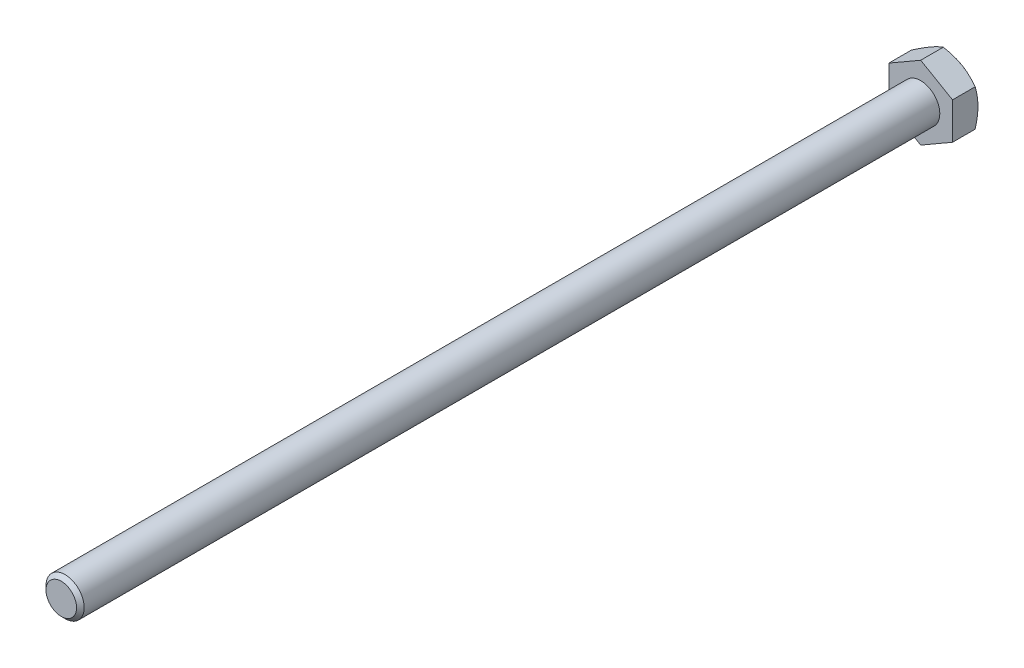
ISO-10303-21;
HEADER;
FILE_DESCRIPTION(('STEP AP214'),'2;1');
FILE_NAME('part.step','',(''),(''),'','','');
FILE_SCHEMA(('AUTOMOTIVE_DESIGN { 1 0 10303 214 1 1 1 1 }'));
ENDSEC;
DATA;
#1=APPLICATION_CONTEXT('core data for automotive mechanical design processes');
#2=APPLICATION_PROTOCOL_DEFINITION('international standard','automotive_design',2000,#1);
#3=PRODUCT_CONTEXT('',#1,'mechanical');
#4=PRODUCT('Part','Part','',(#3));
#5=PRODUCT_RELATED_PRODUCT_CATEGORY('part','',(#4));
#6=PRODUCT_DEFINITION_FORMATION('','',#4);
#7=PRODUCT_DEFINITION_CONTEXT('part definition',#1,'design');
#8=PRODUCT_DEFINITION('design','',#6,#7);
#9=PRODUCT_DEFINITION_SHAPE('','',#8);
#10=(LENGTH_UNIT() NAMED_UNIT(*) SI_UNIT(.MILLI.,.METRE.));
#11=(NAMED_UNIT(*) PLANE_ANGLE_UNIT() SI_UNIT($,.RADIAN.));
#12=(NAMED_UNIT(*) SI_UNIT($,.STERADIAN.) SOLID_ANGLE_UNIT());
#13=UNCERTAINTY_MEASURE_WITH_UNIT(LENGTH_MEASURE(1.E-05),#10,'distance_accuracy_value','');
#14=(GEOMETRIC_REPRESENTATION_CONTEXT(3) GLOBAL_UNCERTAINTY_ASSIGNED_CONTEXT((#13)) GLOBAL_UNIT_ASSIGNED_CONTEXT((#10,
#11,#12)) REPRESENTATION_CONTEXT('',''));
#15=CARTESIAN_POINT('',(0.,0.,0.));
#16=DIRECTION('',(0.,0.,1.));
#17=DIRECTION('',(1.,0.,0.));
#18=AXIS2_PLACEMENT_3D('',#15,#16,#17);
#19=CARTESIAN_POINT('',(0.,0.,135.));
#20=DIRECTION('',(0.,0.,1.));
#21=DIRECTION('',(1.,0.,0.));
#22=AXIS2_PLACEMENT_3D('',#19,#20,#21);
#23=PLANE('',#22);
#24=CARTESIAN_POINT('',(0.,0.,135.));
#25=DIRECTION('',(0.,0.,1.));
#26=DIRECTION('',(1.,0.,0.));
#27=AXIS2_PLACEMENT_3D('',#24,#25,#26);
#28=CIRCLE('',#27,2.40000000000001);
#29=CARTESIAN_POINT('',(2.40000000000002,0.,135.));
#30=VERTEX_POINT('',#29);
#31=EDGE_CURVE('E214',#30,#30,#28,.T.);
#32=ORIENTED_EDGE('',*,*,#31,.T.);
#33=EDGE_LOOP('',(#32));
#34=FACE_BOUND('',#33,.T.);
#35=ADVANCED_FACE('F40',(#34),#23,.T.);
#36=CARTESIAN_POINT('',(0.,0.,0.));
#37=DIRECTION('',(0.,0.,1.));
#38=DIRECTION('',(1.,0.,0.));
#39=AXIS2_PLACEMENT_3D('',#36,#37,#38);
#40=CYLINDRICAL_SURFACE('',#39,3.);
#41=CARTESIAN_POINT('',(0.,0.,134.4));
#42=DIRECTION('',(0.,0.,1.));
#43=DIRECTION('',(1.,0.,0.));
#44=AXIS2_PLACEMENT_3D('',#41,#42,#43);
#45=CIRCLE('',#44,3.);
#46=CARTESIAN_POINT('',(3.00000000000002,0.,134.4));
#47=VERTEX_POINT('',#46);
#48=EDGE_CURVE('E216',#47,#47,#45,.F.);
#49=ORIENTED_EDGE('',*,*,#48,.T.);
#50=EDGE_LOOP('',(#49));
#51=FACE_BOUND('',#50,.T.);
#52=CARTESIAN_POINT('',(0.,0.,0.));
#53=DIRECTION('',(0.,0.,1.));
#54=DIRECTION('',(1.,0.,0.));
#55=AXIS2_PLACEMENT_3D('',#52,#53,#54);
#56=CIRCLE('',#55,3.);
#57=CARTESIAN_POINT('',(3.,0.,0.));
#58=VERTEX_POINT('',#57);
#59=EDGE_CURVE('E217',#58,#58,#56,.F.);
#60=ORIENTED_EDGE('',*,*,#59,.F.);
#61=EDGE_LOOP('',(#60));
#62=FACE_BOUND('',#61,.T.);
#63=ADVANCED_FACE('F205',(#51,#62),#40,.T.);
#64=CARTESIAN_POINT('',(0.,0.,135.));
#65=DIRECTION('',(0.,0.,-1.));
#66=DIRECTION('',(-1.,0.,0.));
#67=AXIS2_PLACEMENT_3D('',#64,#65,#66);
#68=CONICAL_SURFACE('',#67,2.40000000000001,0.78539816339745);
#69=ORIENTED_EDGE('',*,*,#48,.F.);
#70=EDGE_LOOP('',(#69));
#71=FACE_BOUND('',#70,.T.);
#72=ORIENTED_EDGE('',*,*,#31,.F.);
#73=EDGE_LOOP('',(#72));
#74=FACE_BOUND('',#73,.T.);
#75=ADVANCED_FACE('F210',(#71,#74),#68,.T.);
#76=CARTESIAN_POINT('',(0.,5.77350269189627,-4.));
#77=DIRECTION('',(0.499999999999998,0.86602540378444,0.));
#78=DIRECTION('',(-0.86602540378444,0.499999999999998,0.));
#79=AXIS2_PLACEMENT_3D('',#76,#77,#78);
#80=PLANE('',#79);
#81=CARTESIAN_POINT('',(-0.000200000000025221,5.77361816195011,-3.55335134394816));
#82=CARTESIAN_POINT('',(0.21953459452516,5.64675433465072,-3.62661343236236));
#83=CARTESIAN_POINT('',(0.441148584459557,5.51880543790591,-3.6932486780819));
#84=CARTESIAN_POINT('',(0.888213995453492,5.26069210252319,-3.80956100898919));
#85=CARTESIAN_POINT('',(1.11367335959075,5.13052307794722,-3.85919695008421));
#86=CARTESIAN_POINT('',(1.56183230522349,4.87177839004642,-3.9364489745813));
#87=CARTESIAN_POINT('',(1.78446209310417,4.74324302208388,-3.96457962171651));
#88=CARTESIAN_POINT('',(2.11918990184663,4.54998783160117,-3.98980507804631));
#89=CARTESIAN_POINT('',(2.23084219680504,4.48552534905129,-3.99538654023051));
#90=CARTESIAN_POINT('',(2.45424997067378,4.35654081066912,-4.00079778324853));
#91=CARTESIAN_POINT('',(2.5660054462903,4.29201875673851,-4.0006277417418));
#92=CARTESIAN_POINT('',(2.87218423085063,4.11524635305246,-3.99224636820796));
#93=CARTESIAN_POINT('',(3.0665060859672,4.00305457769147,-3.97817022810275));
#94=CARTESIAN_POINT('',(3.4538601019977,3.77941563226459,-3.93353474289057));
#95=CARTESIAN_POINT('',(3.64689090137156,3.6679692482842,-3.90296013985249));
#96=CARTESIAN_POINT('',(4.03502534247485,3.44387972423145,-3.82653150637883));
#97=CARTESIAN_POINT('',(4.23007999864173,3.33126486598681,-3.78035362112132));
#98=CARTESIAN_POINT('',(4.61728034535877,3.10771464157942,-3.67554820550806));
#99=CARTESIAN_POINT('',(4.80943099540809,2.99677641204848,-3.61694529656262));
#100=CARTESIAN_POINT('',(5.0002,2.8866358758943,-3.55335134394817));
#101=B_SPLINE_CURVE_WITH_KNOTS('',3,(#81,#82,#83,#84,#85,#86,#87,#88,#89,#90,#91,#92,#93,#94,
#95,#96,#97,#98,#99,#100),.UNSPECIFIED.,.F.,.F.,(4,2,2,2,2,2,2,2,2,4),(0.,0.792555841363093,
1.58701660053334,2.36181537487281,2.74884076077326,3.13585419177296,3.8096236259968,
4.48401723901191,5.17336882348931,5.86136694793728),.UNSPECIFIED.);
#102=CARTESIAN_POINT('',(0.,5.77350269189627,-3.55341801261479));
#103=VERTEX_POINT('',#102);
#104=CARTESIAN_POINT('',(2.49999999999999,4.3301270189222,-4.));
#105=VERTEX_POINT('',#104);
#106=EDGE_CURVE('E250',#103,#105,#101,.T.);
#107=ORIENTED_EDGE('',*,*,#106,.F.);
#108=DIRECTION('',(0.,0.,1.));
#109=VECTOR('',#108,1.);
#110=CARTESIAN_POINT('',(0.,5.77350269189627,-4.));
#111=LINE('',#110,#109);
#112=CARTESIAN_POINT('',(0.,5.77350269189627,0.));
#113=VERTEX_POINT('',#112);
#114=EDGE_CURVE('E224',#103,#113,#111,.T.);
#115=ORIENTED_EDGE('',*,*,#114,.T.);
#116=DIRECTION('',(-0.86602540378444,0.499999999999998,0.));
#117=VECTOR('',#116,1.);
#118=CARTESIAN_POINT('',(0.,5.77350269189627,0.));
#119=LINE('',#118,#117);
#120=CARTESIAN_POINT('',(5.,2.88675134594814,0.));
#121=VERTEX_POINT('',#120);
#122=EDGE_CURVE('E248',#121,#113,#119,.T.);
#123=ORIENTED_EDGE('',*,*,#122,.F.);
#124=DIRECTION('',(0.,0.,1.));
#125=VECTOR('',#124,1.);
#126=CARTESIAN_POINT('',(5.,2.88675134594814,-4.));
#127=LINE('',#126,#125);
#128=CARTESIAN_POINT('',(5.,2.88675134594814,-3.55341801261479));
#129=VERTEX_POINT('',#128);
#130=EDGE_CURVE('E221',#129,#121,#127,.T.);
#131=ORIENTED_EDGE('',*,*,#130,.F.);
#132=EDGE_CURVE('E180',#105,#129,#101,.T.);
#133=ORIENTED_EDGE('',*,*,#132,.F.);
#134=EDGE_LOOP('',(#107,#115,#123,#131,#133));
#135=FACE_BOUND('',#134,.T.);
#136=ADVANCED_FACE('F190',(#135),#80,.T.);
#137=CARTESIAN_POINT('',(5.,-2.88675134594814,-4.));
#138=DIRECTION('',(1.,0.,0.));
#139=DIRECTION('',(0.,0.,-1.));
#140=AXIS2_PLACEMENT_3D('',#137,#138,#139);
#141=PLANE('',#140);
#142=CARTESIAN_POINT('',(5.,-7.87365701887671,-1.5017575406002));
#143=CARTESIAN_POINT('',(5.,-7.65421637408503,-1.60868091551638));
#144=CARTESIAN_POINT('',(5.,-7.43428458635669,-1.71461296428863));
#145=CARTESIAN_POINT('',(5.,-6.99317792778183,-1.92393906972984));
#146=CARTESIAN_POINT('',(5.,-6.77200287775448,-2.02733274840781));
#147=CARTESIAN_POINT('',(5.,-6.32706593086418,-2.23152152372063));
#148=CARTESIAN_POINT('',(5.,-6.10329657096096,-2.3323004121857));
#149=CARTESIAN_POINT('',(5.,-5.65401907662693,-2.52988978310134));
#150=CARTESIAN_POINT('',(5.,-5.42851102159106,-2.62670044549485));
#151=CARTESIAN_POINT('',(5.,-4.96773019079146,-2.81850105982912));
#152=CARTESIAN_POINT('',(5.,-4.73238523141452,-2.91331851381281));
#153=CARTESIAN_POINT('',(5.,-4.2589865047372,-3.09606229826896));
#154=CARTESIAN_POINT('',(5.,-4.02093244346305,-3.18398787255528));
#155=CARTESIAN_POINT('',(5.,-3.54214478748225,-3.35072723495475));
#156=CARTESIAN_POINT('',(5.,-3.301417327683,-3.42955846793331));
#157=CARTESIAN_POINT('',(5.,-2.81651125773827,-3.57565910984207));
#158=CARTESIAN_POINT('',(5.,-2.57233372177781,-3.64293203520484));
#159=CARTESIAN_POINT('',(5.,-2.08173956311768,-3.7624103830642));
#160=CARTESIAN_POINT('',(5.,-1.83534384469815,-3.81470009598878));
#161=CARTESIAN_POINT('',(5.,-1.33936717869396,-3.90133365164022));
#162=CARTESIAN_POINT('',(5.,-1.08978658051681,-3.93567944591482));
#163=CARTESIAN_POINT('',(5.,-0.591994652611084,-3.98324171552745));
#164=CARTESIAN_POINT('',(5.,-0.343810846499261,-3.99673913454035));
#165=CARTESIAN_POINT('',(5.,0.152820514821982,-4.00220795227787));
#166=CARTESIAN_POINT('',(5.,0.401268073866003,-3.99417903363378));
#167=CARTESIAN_POINT('',(5.,0.819539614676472,-3.96311999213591));
#168=CARTESIAN_POINT('',(5.,0.989794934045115,-3.94552930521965));
#169=CARTESIAN_POINT('',(5.,1.32912938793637,-3.90127081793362));
#170=CARTESIAN_POINT('',(5.,1.4982083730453,-3.87460188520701));
#171=CARTESIAN_POINT('',(5.,2.00341173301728,-3.78237229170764));
#172=CARTESIAN_POINT('',(5.,2.33733597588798,-3.7046029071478));
#173=CARTESIAN_POINT('',(5.,2.83691487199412,-3.56883106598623));
#174=CARTESIAN_POINT('',(5.,3.00513229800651,-3.51971360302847));
#175=CARTESIAN_POINT('',(5.,3.33993504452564,-3.41615110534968));
#176=CARTESIAN_POINT('',(5.,3.50652035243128,-3.36170602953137));
#177=CARTESIAN_POINT('',(5.,3.83810926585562,-3.24838071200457));
#178=CARTESIAN_POINT('',(5.,4.00311330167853,-3.18950171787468));
#179=CARTESIAN_POINT('',(5.,4.33173746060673,-3.06802383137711));
#180=CARTESIAN_POINT('',(5.,4.49535761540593,-3.00542502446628));
#181=CARTESIAN_POINT('',(5.,4.93598294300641,-2.83201950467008));
#182=CARTESIAN_POINT('',(5.,5.21182602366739,-2.71826266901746));
#183=CARTESIAN_POINT('',(5.,5.76066658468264,-2.48405585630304));
#184=CARTESIAN_POINT('',(5.,6.03366374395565,-2.36360513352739));
#185=CARTESIAN_POINT('',(5.,6.57746623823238,-2.11759609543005));
#186=CARTESIAN_POINT('',(5.,6.84827068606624,-1.99203582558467));
#187=CARTESIAN_POINT('',(5.,7.38802449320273,-1.73703058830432));
#188=CARTESIAN_POINT('',(5.,7.65697392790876,-1.60758577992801));
#189=CARTESIAN_POINT('',(5.,8.19381940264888,-1.34544789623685));
#190=CARTESIAN_POINT('',(5.,8.46171304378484,-1.21274991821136));
#191=CARTESIAN_POINT('',(5.,8.99628800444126,-0.944933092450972));
#192=CARTESIAN_POINT('',(5.,9.2629693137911,-0.809814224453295));
#193=CARTESIAN_POINT('',(5.,10.0614145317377,-0.40162739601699));
#194=CARTESIAN_POINT('',(5.,10.5917004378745,-0.12566969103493));
#195=CARTESIAN_POINT('',(5.,11.5934978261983,0.401869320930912));
#196=CARTESIAN_POINT('',(5.,12.0652823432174,0.652934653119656));
#197=CARTESIAN_POINT('',(5.,13.0072652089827,1.15809174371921));
#198=CARTESIAN_POINT('',(5.,13.4774634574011,1.41218368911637));
#199=CARTESIAN_POINT('',(5.,14.4150598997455,1.92174727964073));
#200=CARTESIAN_POINT('',(5.,14.8824621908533,2.17721139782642));
#201=CARTESIAN_POINT('',(5.,15.8162766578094,2.68985606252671));
#202=CARTESIAN_POINT('',(5.,16.2826889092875,2.94703647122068));
#203=CARTESIAN_POINT('',(5.,16.7487534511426,3.20484156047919));
#204=B_SPLINE_CURVE_WITH_KNOTS('',3,(#142,#143,#144,#145,#146,#147,#148,#149,#150,#151,#152,
#153,#154,#155,#156,#157,#158,#159,#160,#161,#162,#163,#164,#165,#166,#167,#168,#169,#170,#171,
#172,#173,#174,#175,#176,#177,#178,#179,#180,#181,#182,#183,#184,#185,#186,#187,#188,#189,#190,
#191,#192,#193,#194,#195,#196,#197,#198,#199,#200,#201,#202,#203),.UNSPECIFIED.,.F.,.F.,(4,2,2,
2,2,2,2,2,2,2,2,2,2,2,2,2,2,2,2,2,2,2,2,2,2,2,2,2,2,2,4),(0.,0.732320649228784,1.46474969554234,
2.20096737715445,2.93715163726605,3.69825037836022,4.45943251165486,5.2191293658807,
5.97859468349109,6.73369963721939,7.48872245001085,8.23347928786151,8.97824710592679,
9.49148539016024,10.0047877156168,11.0318914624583,11.5575684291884,12.0832494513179,
12.6087831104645,13.1343047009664,14.0293094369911,14.9244140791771,15.819864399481,
16.7152781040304,17.612136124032,18.5090016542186,20.3023290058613,21.9056050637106,
23.5089806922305,25.106957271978,26.7048070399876),.UNSPECIFIED.);
#205=CARTESIAN_POINT('',(5.,0.,-4.));
#206=VERTEX_POINT('',#205);
#207=EDGE_CURVE('E178',#129,#206,#204,.F.);
#208=ORIENTED_EDGE('',*,*,#207,.F.);
#209=ORIENTED_EDGE('',*,*,#130,.T.);
#210=DIRECTION('',(0.,1.,0.));
#211=VECTOR('',#210,1.);
#212=CARTESIAN_POINT('',(5.,-2.88675134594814,0.));
#213=LINE('',#212,#211);
#214=CARTESIAN_POINT('',(5.,-2.88675134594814,0.));
#215=VERTEX_POINT('',#214);
#216=EDGE_CURVE('E226',#215,#121,#213,.T.);
#217=ORIENTED_EDGE('',*,*,#216,.F.);
#218=DIRECTION('',(0.,0.,1.));
#219=VECTOR('',#218,1.);
#220=CARTESIAN_POINT('',(5.,-2.88675134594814,-4.));
#221=LINE('',#220,#219);
#222=CARTESIAN_POINT('',(5.,-2.88675134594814,-3.55341801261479));
#223=VERTEX_POINT('',#222);
#224=EDGE_CURVE('E232',#223,#215,#221,.T.);
#225=ORIENTED_EDGE('',*,*,#224,.F.);
#226=EDGE_CURVE('E173',#206,#223,#204,.F.);
#227=ORIENTED_EDGE('',*,*,#226,.F.);
#228=EDGE_LOOP('',(#208,#209,#217,#225,#227));
#229=FACE_BOUND('',#228,.T.);
#230=ADVANCED_FACE('F186',(#229),#141,.T.);
#231=CARTESIAN_POINT('',(0.,-5.77350269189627,-4.));
#232=DIRECTION('',(0.499999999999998,-0.86602540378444,0.));
#233=DIRECTION('',(0.86602540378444,0.499999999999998,0.));
#234=AXIS2_PLACEMENT_3D('',#231,#232,#233);
#235=PLANE('',#234);
#236=CARTESIAN_POINT('',(5.0002,-2.8866358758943,-3.55335134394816));
#237=CARTESIAN_POINT('',(4.78046540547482,-3.01349970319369,-3.62661343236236));
#238=CARTESIAN_POINT('',(4.55885141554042,-3.1414485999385,-3.6932486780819));
#239=CARTESIAN_POINT('',(4.11178600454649,-3.39956193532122,-3.80956100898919));
#240=CARTESIAN_POINT('',(3.88632664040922,-3.52973095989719,-3.85919695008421));
#241=CARTESIAN_POINT('',(3.43816769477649,-3.78847564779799,-3.9364489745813));
#242=CARTESIAN_POINT('',(3.2155379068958,-3.91701101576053,-3.96457962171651));
#243=CARTESIAN_POINT('',(2.88081009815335,-4.11026620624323,-3.98980507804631));
#244=CARTESIAN_POINT('',(2.76915780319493,-4.17472868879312,-3.99538654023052));
#245=CARTESIAN_POINT('',(2.54575002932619,-4.30371322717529,-4.00079778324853));
#246=CARTESIAN_POINT('',(2.43399455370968,-4.3682352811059,-4.0006277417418));
#247=CARTESIAN_POINT('',(2.12781576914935,-4.54500768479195,-3.99224636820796));
#248=CARTESIAN_POINT('',(1.93349391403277,-4.65719946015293,-3.97817022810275));
#249=CARTESIAN_POINT('',(1.54613989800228,-4.88083840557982,-3.93353474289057));
#250=CARTESIAN_POINT('',(1.35310909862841,-4.99228478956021,-3.90296013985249));
#251=CARTESIAN_POINT('',(0.964974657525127,-5.21637431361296,-3.82653150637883));
#252=CARTESIAN_POINT('',(0.769920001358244,-5.3289891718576,-3.78035362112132));
#253=CARTESIAN_POINT('',(0.382719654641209,-5.55253939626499,-3.67554820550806));
#254=CARTESIAN_POINT('',(0.19056900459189,-5.66347762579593,-3.61694529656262));
#255=CARTESIAN_POINT('',(-0.000200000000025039,-5.77361816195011,-3.55335134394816));
#256=B_SPLINE_CURVE_WITH_KNOTS('',3,(#236,#237,#238,#239,#240,#241,#242,#243,#244,#245,#246,
#247,#248,#249,#250,#251,#252,#253,#254,#255),.UNSPECIFIED.,.F.,.F.,(4,2,2,2,2,2,2,2,2,4),(0.,
0.792555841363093,1.58701660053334,2.36181537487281,2.74884076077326,3.13585419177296,
3.80962362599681,4.48401723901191,5.17336882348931,5.86136694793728),.UNSPECIFIED.);
#257=CARTESIAN_POINT('',(2.49999999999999,-4.3301270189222,-4.));
#258=VERTEX_POINT('',#257);
#259=EDGE_CURVE('E179',#223,#258,#256,.T.);
#260=ORIENTED_EDGE('',*,*,#259,.F.);
#261=ORIENTED_EDGE('',*,*,#224,.T.);
#262=DIRECTION('',(0.86602540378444,0.499999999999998,0.));
#263=VECTOR('',#262,1.);
#264=CARTESIAN_POINT('',(0.,-5.77350269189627,0.));
#265=LINE('',#264,#263);
#266=CARTESIAN_POINT('',(0.,-5.77350269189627,0.));
#267=VERTEX_POINT('',#266);
#268=EDGE_CURVE('E237',#267,#215,#265,.T.);
#269=ORIENTED_EDGE('',*,*,#268,.F.);
#270=DIRECTION('',(0.,0.,1.));
#271=VECTOR('',#270,1.);
#272=CARTESIAN_POINT('',(0.,-5.77350269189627,-4.));
#273=LINE('',#272,#271);
#274=CARTESIAN_POINT('',(0.,-5.77350269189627,-3.55341801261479));
#275=VERTEX_POINT('',#274);
#276=EDGE_CURVE('E230',#275,#267,#273,.T.);
#277=ORIENTED_EDGE('',*,*,#276,.F.);
#278=EDGE_CURVE('E167',#258,#275,#256,.T.);
#279=ORIENTED_EDGE('',*,*,#278,.F.);
#280=EDGE_LOOP('',(#260,#261,#269,#277,#279));
#281=FACE_BOUND('',#280,.T.);
#282=ADVANCED_FACE('F189',(#281),#235,.T.);
#283=CARTESIAN_POINT('',(0.,-5.77350269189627,-4.));
#284=DIRECTION('',(-0.500000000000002,-0.866025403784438,0.));
#285=DIRECTION('',(0.866025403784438,-0.500000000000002,0.));
#286=AXIS2_PLACEMENT_3D('',#283,#284,#285);
#287=PLANE('',#286);
#288=CARTESIAN_POINT('',(0.000199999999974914,-5.77361816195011,-3.55335134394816));
#289=CARTESIAN_POINT('',(-0.219534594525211,-5.64675433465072,-3.62661343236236));
#290=CARTESIAN_POINT('',(-0.441148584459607,-5.5188054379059,-3.6932486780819));
#291=CARTESIAN_POINT('',(-0.88821399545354,-5.26069210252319,-3.80956100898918));
#292=CARTESIAN_POINT('',(-1.1136733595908,-5.13052307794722,-3.85919695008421));
#293=CARTESIAN_POINT('',(-1.56183230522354,-4.87177839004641,-3.9364489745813));
#294=CARTESIAN_POINT('',(-1.78446209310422,-4.74324302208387,-3.96457962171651));
#295=CARTESIAN_POINT('',(-2.11918990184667,-4.54998783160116,-3.98980507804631));
#296=CARTESIAN_POINT('',(-2.23084219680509,-4.48552534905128,-3.99538654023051));
#297=CARTESIAN_POINT('',(-2.45424997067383,-4.35654081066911,-4.00079778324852));
#298=CARTESIAN_POINT('',(-2.56600544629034,-4.2920187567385,-4.00062774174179));
#299=CARTESIAN_POINT('',(-2.87218423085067,-4.11524635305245,-3.99224636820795));
#300=CARTESIAN_POINT('',(-3.06650608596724,-4.00305457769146,-3.97817022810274));
#301=CARTESIAN_POINT('',(-3.45386010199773,-3.77941563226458,-3.93353474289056));
#302=CARTESIAN_POINT('',(-3.64689090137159,-3.66796924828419,-3.90296013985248));
#303=CARTESIAN_POINT('',(-4.03502534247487,-3.44387972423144,-3.82653150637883));
#304=CARTESIAN_POINT('',(-4.23007999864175,-3.33126486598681,-3.78035362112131));
#305=CARTESIAN_POINT('',(-4.61728034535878,-3.10771464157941,-3.67554820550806));
#306=CARTESIAN_POINT('',(-4.80943099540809,-2.99677641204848,-3.61694529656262));
#307=CARTESIAN_POINT('',(-5.0002,-2.8866358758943,-3.55335134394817));
#308=B_SPLINE_CURVE_WITH_KNOTS('',3,(#288,#289,#290,#291,#292,#293,#294,#295,#296,#297,#298,
#299,#300,#301,#302,#303,#304,#305,#306,#307),.UNSPECIFIED.,.F.,.F.,(4,2,2,2,2,2,2,2,2,4),(0.,
0.792555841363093,1.58701660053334,2.36181537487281,2.74884076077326,3.13585419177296,
3.80962362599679,4.48401723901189,5.17336882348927,5.86136694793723),.UNSPECIFIED.);
#309=CARTESIAN_POINT('',(-2.50000000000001,-4.33012701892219,-4.));
#310=VERTEX_POINT('',#309);
#311=EDGE_CURVE('E269',#275,#310,#308,.T.);
#312=ORIENTED_EDGE('',*,*,#311,.F.);
#313=ORIENTED_EDGE('',*,*,#276,.T.);
#314=DIRECTION('',(0.866025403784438,-0.500000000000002,0.));
#315=VECTOR('',#314,1.);
#316=CARTESIAN_POINT('',(0.,-5.77350269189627,0.));
#317=LINE('',#316,#315);
#318=CARTESIAN_POINT('',(-5.,-2.88675134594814,0.));
#319=VERTEX_POINT('',#318);
#320=EDGE_CURVE('E240',#319,#267,#317,.T.);
#321=ORIENTED_EDGE('',*,*,#320,.F.);
#322=DIRECTION('',(0.,0.,1.));
#323=VECTOR('',#322,1.);
#324=CARTESIAN_POINT('',(-5.,-2.88675134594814,-4.));
#325=LINE('',#324,#323);
#326=CARTESIAN_POINT('',(-5.,-2.88675134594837,-3.55341801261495));
#327=VERTEX_POINT('',#326);
#328=EDGE_CURVE('E228',#327,#319,#325,.T.);
#329=ORIENTED_EDGE('',*,*,#328,.F.);
#330=EDGE_CURVE('E116',#310,#327,#308,.T.);
#331=ORIENTED_EDGE('',*,*,#330,.F.);
#332=EDGE_LOOP('',(#312,#313,#321,#329,#331));
#333=FACE_BOUND('',#332,.T.);
#334=ADVANCED_FACE('F194',(#333),#287,.T.);
#335=CARTESIAN_POINT('',(-5.,-2.88675134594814,-4.));
#336=DIRECTION('',(-1.,0.,0.));
#337=DIRECTION('',(0.,0.,1.));
#338=AXIS2_PLACEMENT_3D('',#335,#336,#337);
#339=PLANE('',#338);
#340=CARTESIAN_POINT('',(-5.,-7.87365701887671,-1.5017575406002));
#341=CARTESIAN_POINT('',(-5.,-7.65421637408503,-1.60868091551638));
#342=CARTESIAN_POINT('',(-5.,-7.43428458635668,-1.71461296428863));
#343=CARTESIAN_POINT('',(-5.,-6.99317792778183,-1.92393906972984));
#344=CARTESIAN_POINT('',(-5.,-6.77200287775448,-2.02733274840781));
#345=CARTESIAN_POINT('',(-5.,-6.32706593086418,-2.23152152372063));
#346=CARTESIAN_POINT('',(-5.,-6.10329657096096,-2.3323004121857));
#347=CARTESIAN_POINT('',(-5.,-5.65401907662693,-2.52988978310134));
#348=CARTESIAN_POINT('',(-5.,-5.42851102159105,-2.62670044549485));
#349=CARTESIAN_POINT('',(-5.,-4.96773019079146,-2.81850105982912));
#350=CARTESIAN_POINT('',(-5.,-4.73238523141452,-2.91331851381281));
#351=CARTESIAN_POINT('',(-5.,-4.2589865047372,-3.09606229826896));
#352=CARTESIAN_POINT('',(-5.,-4.02093244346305,-3.18398787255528));
#353=CARTESIAN_POINT('',(-5.,-3.54214478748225,-3.35072723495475));
#354=CARTESIAN_POINT('',(-5.,-3.301417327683,-3.42955846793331));
#355=CARTESIAN_POINT('',(-5.,-2.81651125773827,-3.57565910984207));
#356=CARTESIAN_POINT('',(-5.,-2.57233372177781,-3.64293203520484));
#357=CARTESIAN_POINT('',(-5.,-2.08173956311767,-3.7624103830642));
#358=CARTESIAN_POINT('',(-5.,-1.83534384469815,-3.81470009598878));
#359=CARTESIAN_POINT('',(-5.,-1.33936717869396,-3.90133365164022));
#360=CARTESIAN_POINT('',(-5.,-1.08978658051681,-3.93567944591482));
#361=CARTESIAN_POINT('',(-5.,-0.591994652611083,-3.98324171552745));
#362=CARTESIAN_POINT('',(-5.,-0.343810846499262,-3.99673913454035));
#363=CARTESIAN_POINT('',(-5.,0.152820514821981,-4.00220795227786));
#364=CARTESIAN_POINT('',(-5.,0.401268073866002,-3.99417903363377));
#365=CARTESIAN_POINT('',(-5.,0.819539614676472,-3.96311999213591));
#366=CARTESIAN_POINT('',(-5.,0.989794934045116,-3.94552930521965));
#367=CARTESIAN_POINT('',(-5.,1.32912938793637,-3.90127081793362));
#368=CARTESIAN_POINT('',(-5.,1.4982083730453,-3.87460188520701));
#369=CARTESIAN_POINT('',(-5.,2.00341173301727,-3.78237229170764));
#370=CARTESIAN_POINT('',(-5.,2.33733597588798,-3.7046029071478));
#371=CARTESIAN_POINT('',(-5.,2.83691487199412,-3.56883106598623));
#372=CARTESIAN_POINT('',(-5.,3.00513229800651,-3.51971360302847));
#373=CARTESIAN_POINT('',(-5.,3.33993504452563,-3.41615110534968));
#374=CARTESIAN_POINT('',(-5.,3.50652035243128,-3.36170602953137));
#375=CARTESIAN_POINT('',(-5.,3.83810926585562,-3.24838071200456));
#376=CARTESIAN_POINT('',(-5.,4.00311330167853,-3.18950171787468));
#377=CARTESIAN_POINT('',(-5.,4.33173746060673,-3.06802383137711));
#378=CARTESIAN_POINT('',(-5.,4.49535761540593,-3.00542502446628));
#379=CARTESIAN_POINT('',(-5.,4.93598294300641,-2.83201950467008));
#380=CARTESIAN_POINT('',(-5.,5.21182602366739,-2.71826266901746));
#381=CARTESIAN_POINT('',(-5.,5.76066658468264,-2.48405585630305));
#382=CARTESIAN_POINT('',(-5.,6.03366374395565,-2.36360513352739));
#383=CARTESIAN_POINT('',(-5.,6.57746623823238,-2.11759609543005));
#384=CARTESIAN_POINT('',(-5.,6.84827068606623,-1.99203582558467));
#385=CARTESIAN_POINT('',(-5.,7.38802449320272,-1.73703058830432));
#386=CARTESIAN_POINT('',(-5.,7.65697392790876,-1.60758577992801));
#387=CARTESIAN_POINT('',(-5.,8.19381940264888,-1.34544789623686));
#388=CARTESIAN_POINT('',(-5.,8.46171304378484,-1.21274991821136));
#389=CARTESIAN_POINT('',(-5.,8.99628800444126,-0.944933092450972));
#390=CARTESIAN_POINT('',(-5.,9.26296931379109,-0.809814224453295));
#391=CARTESIAN_POINT('',(-5.,10.0614145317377,-0.40162739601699));
#392=CARTESIAN_POINT('',(-5.,10.5917004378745,-0.125669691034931));
#393=CARTESIAN_POINT('',(-5.,11.5934978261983,0.40186932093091));
#394=CARTESIAN_POINT('',(-5.,12.0652823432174,0.652934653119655));
#395=CARTESIAN_POINT('',(-5.,13.0072652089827,1.15809174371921));
#396=CARTESIAN_POINT('',(-5.,13.4774634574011,1.41218368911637));
#397=CARTESIAN_POINT('',(-5.,14.4150598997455,1.92174727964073));
#398=CARTESIAN_POINT('',(-5.,14.8824621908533,2.17721139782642));
#399=CARTESIAN_POINT('',(-5.,15.8162766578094,2.68985606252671));
#400=CARTESIAN_POINT('',(-5.,16.2826889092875,2.94703647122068));
#401=CARTESIAN_POINT('',(-5.,16.7487534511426,3.20484156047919));
#402=B_SPLINE_CURVE_WITH_KNOTS('',3,(#340,#341,#342,#343,#344,#345,#346,#347,#348,#349,#350,
#351,#352,#353,#354,#355,#356,#357,#358,#359,#360,#361,#362,#363,#364,#365,#366,#367,#368,#369,
#370,#371,#372,#373,#374,#375,#376,#377,#378,#379,#380,#381,#382,#383,#384,#385,#386,#387,#388,
#389,#390,#391,#392,#393,#394,#395,#396,#397,#398,#399,#400,#401),.UNSPECIFIED.,.F.,.F.,(4,2,2,
2,2,2,2,2,2,2,2,2,2,2,2,2,2,2,2,2,2,2,2,2,2,2,2,2,2,2,4),(0.,0.732320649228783,1.46474969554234,
2.20096737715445,2.93715163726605,3.69825037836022,4.45943251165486,5.2191293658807,
5.97859468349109,6.7336996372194,7.48872245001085,8.23347928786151,8.97824710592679,
9.49148539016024,10.0047877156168,11.0318914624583,11.5575684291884,12.0832494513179,
12.6087831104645,13.1343047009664,14.0293094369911,14.9244140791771,15.819864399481,
16.7152781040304,17.612136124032,18.5090016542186,20.3023290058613,21.9056050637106,
23.5089806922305,25.106957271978,26.7048070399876),.UNSPECIFIED.);
#403=CARTESIAN_POINT('',(-5.,0.,-4.));
#404=VERTEX_POINT('',#403);
#405=EDGE_CURVE('E111',#327,#404,#402,.T.);
#406=ORIENTED_EDGE('',*,*,#405,.F.);
#407=ORIENTED_EDGE('',*,*,#328,.T.);
#408=DIRECTION('',(0.,-1.,0.));
#409=VECTOR('',#408,1.);
#410=CARTESIAN_POINT('',(-5.,-2.88675134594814,0.));
#411=LINE('',#410,#409);
#412=CARTESIAN_POINT('',(-5.,2.88675134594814,0.));
#413=VERTEX_POINT('',#412);
#414=EDGE_CURVE('E243',#413,#319,#411,.T.);
#415=ORIENTED_EDGE('',*,*,#414,.F.);
#416=DIRECTION('',(0.,0.,1.));
#417=VECTOR('',#416,1.);
#418=CARTESIAN_POINT('',(-5.,2.88675134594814,-4.));
#419=LINE('',#418,#417);
#420=CARTESIAN_POINT('',(-5.,2.88675134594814,-3.55341801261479));
#421=VERTEX_POINT('',#420);
#422=EDGE_CURVE('E137',#421,#413,#419,.T.);
#423=ORIENTED_EDGE('',*,*,#422,.F.);
#424=EDGE_CURVE('E120',#404,#421,#402,.T.);
#425=ORIENTED_EDGE('',*,*,#424,.F.);
#426=EDGE_LOOP('',(#406,#407,#415,#423,#425));
#427=FACE_BOUND('',#426,.T.);
#428=ADVANCED_FACE('F135',(#427),#339,.T.);
#429=CARTESIAN_POINT('',(-5.,2.88675134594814,-4.));
#430=DIRECTION('',(-0.500000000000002,0.866025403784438,0.));
#431=DIRECTION('',(-0.866025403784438,-0.500000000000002,0.));
#432=AXIS2_PLACEMENT_3D('',#429,#430,#431);
#433=PLANE('',#432);
#434=CARTESIAN_POINT('',(-5.0002,2.8866358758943,-3.55335134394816));
#435=CARTESIAN_POINT('',(-4.78046540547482,3.01349970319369,-3.62661343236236));
#436=CARTESIAN_POINT('',(-4.55885141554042,3.1414485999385,-3.6932486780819));
#437=CARTESIAN_POINT('',(-4.11178600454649,3.39956193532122,-3.80956100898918));
#438=CARTESIAN_POINT('',(-3.88632664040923,3.52973095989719,-3.85919695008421));
#439=CARTESIAN_POINT('',(-3.43816769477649,3.78847564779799,-3.9364489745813));
#440=CARTESIAN_POINT('',(-3.21553790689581,3.91701101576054,-3.96457962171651));
#441=CARTESIAN_POINT('',(-2.88081009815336,4.11026620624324,-3.98980507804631));
#442=CARTESIAN_POINT('',(-2.76915780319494,4.17472868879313,-3.99538654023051));
#443=CARTESIAN_POINT('',(-2.5457500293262,4.3037132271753,-4.00079778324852));
#444=CARTESIAN_POINT('',(-2.43399455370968,4.36823528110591,-4.00062774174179));
#445=CARTESIAN_POINT('',(-2.12781576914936,4.54500768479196,-3.99224636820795));
#446=CARTESIAN_POINT('',(-1.93349391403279,4.65719946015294,-3.97817022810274));
#447=CARTESIAN_POINT('',(-1.5461398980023,4.88083840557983,-3.93353474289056));
#448=CARTESIAN_POINT('',(-1.35310909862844,4.99228478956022,-3.90296013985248));
#449=CARTESIAN_POINT('',(-0.96497465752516,5.21637431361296,-3.82653150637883));
#450=CARTESIAN_POINT('',(-0.769920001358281,5.3289891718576,-3.78035362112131));
#451=CARTESIAN_POINT('',(-0.382719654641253,5.55253939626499,-3.67554820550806));
#452=CARTESIAN_POINT('',(-0.190569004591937,5.66347762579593,-3.61694529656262));
#453=CARTESIAN_POINT('',(0.000199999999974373,5.7736181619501,-3.55335134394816));
#454=B_SPLINE_CURVE_WITH_KNOTS('',3,(#434,#435,#436,#437,#438,#439,#440,#441,#442,#443,#444,
#445,#446,#447,#448,#449,#450,#451,#452,#453),.UNSPECIFIED.,.F.,.F.,(4,2,2,2,2,2,2,2,2,4),(0.,
0.792555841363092,1.58701660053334,2.36181537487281,2.74884076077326,3.13585419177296,
3.80962362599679,4.48401723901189,5.17336882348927,5.86136694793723),.UNSPECIFIED.);
#455=CARTESIAN_POINT('',(-2.50000000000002,4.3301270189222,-4.));
#456=VERTEX_POINT('',#455);
#457=EDGE_CURVE('E126',#421,#456,#454,.T.);
#458=ORIENTED_EDGE('',*,*,#457,.F.);
#459=ORIENTED_EDGE('',*,*,#422,.T.);
#460=DIRECTION('',(-0.866025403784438,-0.500000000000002,0.));
#461=VECTOR('',#460,1.);
#462=CARTESIAN_POINT('',(-5.,2.88675134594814,0.));
#463=LINE('',#462,#461);
#464=EDGE_CURVE('E246',#113,#413,#463,.T.);
#465=ORIENTED_EDGE('',*,*,#464,.F.);
#466=ORIENTED_EDGE('',*,*,#114,.F.);
#467=EDGE_CURVE('E128',#456,#103,#454,.T.);
#468=ORIENTED_EDGE('',*,*,#467,.F.);
#469=EDGE_LOOP('',(#458,#459,#465,#466,#468));
#470=FACE_BOUND('',#469,.T.);
#471=ADVANCED_FACE('F202',(#470),#433,.T.);
#472=CARTESIAN_POINT('',(5.,2.88675134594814,0.));
#473=DIRECTION('',(0.,0.,1.));
#474=DIRECTION('',(1.,0.,0.));
#475=AXIS2_PLACEMENT_3D('',#472,#473,#474);
#476=PLANE('',#475);
#477=ORIENTED_EDGE('',*,*,#59,.T.);
#478=EDGE_LOOP('',(#477));
#479=FACE_BOUND('',#478,.T.);
#480=ORIENTED_EDGE('',*,*,#122,.T.);
#481=ORIENTED_EDGE('',*,*,#464,.T.);
#482=ORIENTED_EDGE('',*,*,#414,.T.);
#483=ORIENTED_EDGE('',*,*,#320,.T.);
#484=ORIENTED_EDGE('',*,*,#268,.T.);
#485=ORIENTED_EDGE('',*,*,#216,.T.);
#486=EDGE_LOOP('',(#480,#481,#482,#483,#484,#485));
#487=FACE_BOUND('',#486,.T.);
#488=ADVANCED_FACE('F159',(#479,#487),#476,.T.);
#489=CARTESIAN_POINT('',(0.,0.,0.));
#490=DIRECTION('',(0.,0.,1.));
#491=DIRECTION('',(1.,0.,0.));
#492=AXIS2_PLACEMENT_3D('',#489,#490,#491);
#493=CONICAL_SURFACE('',#492,11.9282032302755,1.0471975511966);
#494=ORIENTED_EDGE('',*,*,#132,.T.);
#495=ORIENTED_EDGE('',*,*,#207,.T.);
#496=CARTESIAN_POINT('',(0.,0.,-4.));
#497=DIRECTION('',(0.,0.,1.));
#498=DIRECTION('',(1.,0.,0.));
#499=AXIS2_PLACEMENT_3D('',#496,#497,#498);
#500=CIRCLE('',#499,5.);
#501=EDGE_CURVE('E43',#105,#206,#500,.F.);
#502=ORIENTED_EDGE('',*,*,#501,.F.);
#503=EDGE_LOOP('',(#494,#495,#502));
#504=FACE_BOUND('',#503,.T.);
#505=ADVANCED_FACE('F259',(#504),#493,.T.);
#506=ORIENTED_EDGE('',*,*,#106,.T.);
#507=EDGE_CURVE('E133',#456,#105,#500,.F.);
#508=ORIENTED_EDGE('',*,*,#507,.F.);
#509=ORIENTED_EDGE('',*,*,#467,.T.);
#510=EDGE_LOOP('',(#506,#508,#509));
#511=FACE_BOUND('',#510,.T.);
#512=ADVANCED_FACE('F158',(#511),#493,.T.);
#513=ORIENTED_EDGE('',*,*,#424,.T.);
#514=ORIENTED_EDGE('',*,*,#457,.T.);
#515=CARTESIAN_POINT('',(0.,0.,-4.));
#516=DIRECTION('',(0.,0.,-1.));
#517=DIRECTION('',(-1.,0.,0.));
#518=AXIS2_PLACEMENT_3D('',#515,#516,#517);
#519=CIRCLE('',#518,5.);
#520=EDGE_CURVE('E61',#404,#456,#519,.T.);
#521=ORIENTED_EDGE('',*,*,#520,.F.);
#522=EDGE_LOOP('',(#513,#514,#521));
#523=FACE_BOUND('',#522,.T.);
#524=ADVANCED_FACE('F124',(#523),#493,.T.);
#525=ORIENTED_EDGE('',*,*,#330,.T.);
#526=ORIENTED_EDGE('',*,*,#405,.T.);
#527=EDGE_CURVE('E113',#310,#404,#500,.F.);
#528=ORIENTED_EDGE('',*,*,#527,.F.);
#529=EDGE_LOOP('',(#525,#526,#528));
#530=FACE_BOUND('',#529,.T.);
#531=ADVANCED_FACE('F112',(#530),#493,.T.);
#532=ORIENTED_EDGE('',*,*,#278,.T.);
#533=ORIENTED_EDGE('',*,*,#311,.T.);
#534=EDGE_CURVE('E48',#258,#310,#500,.F.);
#535=ORIENTED_EDGE('',*,*,#534,.F.);
#536=EDGE_LOOP('',(#532,#533,#535));
#537=FACE_BOUND('',#536,.T.);
#538=ADVANCED_FACE('F271',(#537),#493,.T.);
#539=ORIENTED_EDGE('',*,*,#226,.T.);
#540=ORIENTED_EDGE('',*,*,#259,.T.);
#541=EDGE_CURVE('E11',#206,#258,#500,.F.);
#542=ORIENTED_EDGE('',*,*,#541,.F.);
#543=EDGE_LOOP('',(#539,#540,#542));
#544=FACE_BOUND('',#543,.T.);
#545=ADVANCED_FACE('F266',(#544),#493,.T.);
#546=CARTESIAN_POINT('',(5.,2.88675134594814,-4.));
#547=DIRECTION('',(0.,0.,1.));
#548=DIRECTION('',(1.,0.,0.));
#549=AXIS2_PLACEMENT_3D('',#546,#547,#548);
#550=PLANE('',#549);
#551=ORIENTED_EDGE('',*,*,#501,.T.);
#552=ORIENTED_EDGE('',*,*,#541,.T.);
#553=ORIENTED_EDGE('',*,*,#534,.T.);
#554=ORIENTED_EDGE('',*,*,#527,.T.);
#555=ORIENTED_EDGE('',*,*,#520,.T.);
#556=ORIENTED_EDGE('',*,*,#507,.T.);
#557=EDGE_LOOP('',(#551,#552,#553,#554,#555,#556));
#558=FACE_BOUND('',#557,.T.);
#559=ADVANCED_FACE('F131',(#558),#550,.F.);
#560=CLOSED_SHELL('',(#35,#63,#75,#136,#230,#282,#334,#428,#471,#488,#505,#512,#524,#531,#538,
#545,#559));
#561=MANIFOLD_SOLID_BREP('B2',#560);
#562=ADVANCED_BREP_SHAPE_REPRESENTATION('',(#18,#561),#14);
#563=SHAPE_DEFINITION_REPRESENTATION(#9,#562);
ENDSEC;
END-ISO-10303-21;
